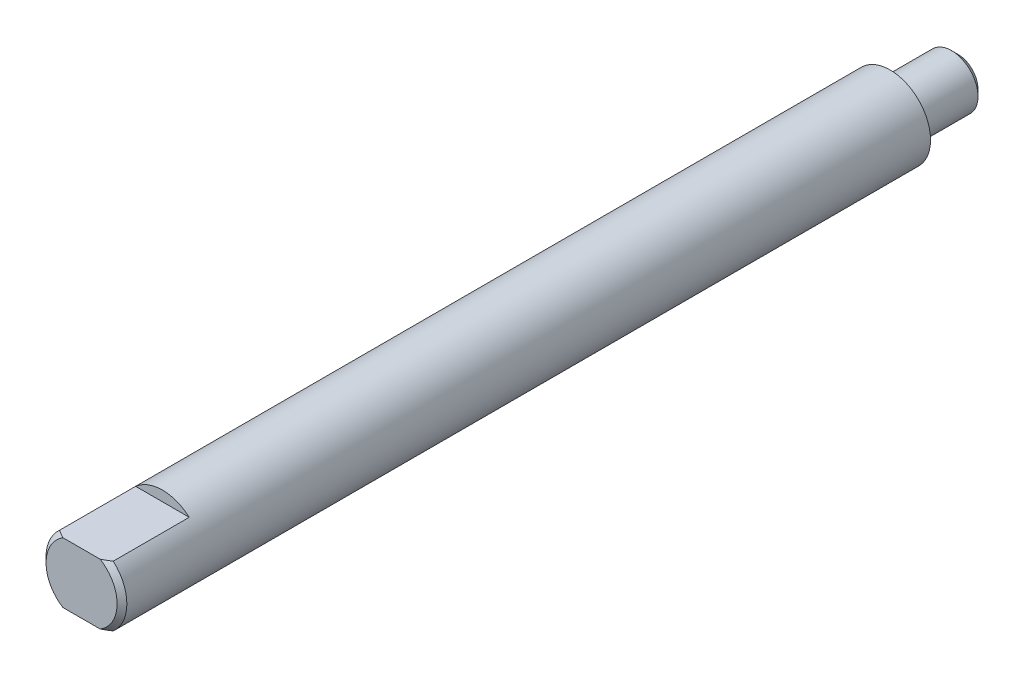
ISO-10303-21;
HEADER;
FILE_DESCRIPTION(('STEP AP214'),'2;1');
FILE_NAME('part.step','',(''),(''),'','','');
FILE_SCHEMA(('AUTOMOTIVE_DESIGN { 1 0 10303 214 1 1 1 1 }'));
ENDSEC;
DATA;
#1=APPLICATION_CONTEXT('core data for automotive mechanical design processes');
#2=APPLICATION_PROTOCOL_DEFINITION('international standard','automotive_design',2000,#1);
#3=PRODUCT_CONTEXT('',#1,'mechanical');
#4=PRODUCT('Part','Part','',(#3));
#5=PRODUCT_RELATED_PRODUCT_CATEGORY('part','',(#4));
#6=PRODUCT_DEFINITION_FORMATION('','',#4);
#7=PRODUCT_DEFINITION_CONTEXT('part definition',#1,'design');
#8=PRODUCT_DEFINITION('design','',#6,#7);
#9=PRODUCT_DEFINITION_SHAPE('','',#8);
#10=(LENGTH_UNIT() NAMED_UNIT(*) SI_UNIT(.MILLI.,.METRE.));
#11=(NAMED_UNIT(*) PLANE_ANGLE_UNIT() SI_UNIT($,.RADIAN.));
#12=(NAMED_UNIT(*) SI_UNIT($,.STERADIAN.) SOLID_ANGLE_UNIT());
#13=UNCERTAINTY_MEASURE_WITH_UNIT(LENGTH_MEASURE(1.E-05),#10,'distance_accuracy_value','');
#14=(GEOMETRIC_REPRESENTATION_CONTEXT(3) GLOBAL_UNCERTAINTY_ASSIGNED_CONTEXT((#13)) GLOBAL_UNIT_ASSIGNED_CONTEXT((#10,
#11,#12)) REPRESENTATION_CONTEXT('',''));
#15=CARTESIAN_POINT('',(0.,0.,0.));
#16=DIRECTION('',(0.,0.,1.));
#17=DIRECTION('',(1.,0.,0.));
#18=AXIS2_PLACEMENT_3D('',#15,#16,#17);
#19=CARTESIAN_POINT('',(0.,0.,3.684));
#20=DIRECTION('',(0.,0.,-1.));
#21=DIRECTION('',(-1.,0.,0.));
#22=AXIS2_PLACEMENT_3D('',#19,#20,#21);
#23=CONICAL_SURFACE('',#22,3.175,0.791934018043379);
#24=CARTESIAN_POINT('',(0.,0.,3.684));
#25=DIRECTION('',(0.,0.,1.));
#26=DIRECTION('',(1.,0.,0.));
#27=AXIS2_PLACEMENT_3D('',#24,#25,#26);
#28=CIRCLE('',#27,3.175);
#29=CARTESIAN_POINT('',(-2.10713075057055,2.375,3.684));
#30=VERTEX_POINT('',#29);
#31=CARTESIAN_POINT('',(-2.10713075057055,-2.375,3.684));
#32=VERTEX_POINT('',#31);
#33=EDGE_CURVE('E105',#30,#32,#28,.T.);
#34=ORIENTED_EDGE('',*,*,#33,.T.);
#35=CARTESIAN_POINT('',(-6.62966945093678,-2.375,-0.13301595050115));
#36=CARTESIAN_POINT('',(-6.41872085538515,-2.375,0.0629362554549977));
#37=CARTESIAN_POINT('',(-6.20729327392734,-2.375,0.258380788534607));
#38=CARTESIAN_POINT('',(-5.78286017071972,-2.375,0.64788739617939));
#39=CARTESIAN_POINT('',(-5.56985352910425,-2.375,0.841948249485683));
#40=CARTESIAN_POINT('',(-5.13574053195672,-2.375,1.23363349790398));
#41=CARTESIAN_POINT('',(-4.9145790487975,-2.375,1.43119690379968));
#42=CARTESIAN_POINT('',(-4.46963283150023,-2.375,1.82304516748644));
#43=CARTESIAN_POINT('',(-4.24585006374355,-2.375,2.01733224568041));
#44=CARTESIAN_POINT('',(-3.90719638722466,-2.375,2.30510248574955));
#45=CARTESIAN_POINT('',(-3.79385459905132,-2.375,2.40038380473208));
#46=CARTESIAN_POINT('',(-3.56590809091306,-2.375,2.5894215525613));
#47=CARTESIAN_POINT('',(-3.4513034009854,-2.375,2.68317801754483));
#48=CARTESIAN_POINT('',(-3.22025369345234,-2.375,2.86895465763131));
#49=CARTESIAN_POINT('',(-3.10380502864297,-2.375,2.96097030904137));
#50=CARTESIAN_POINT('',(-2.8689222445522,-2.375,3.14241965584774));
#51=CARTESIAN_POINT('',(-2.75048831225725,-2.375,3.23185359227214));
#52=CARTESIAN_POINT('',(-2.51255729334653,-2.375,3.40617108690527));
#53=CARTESIAN_POINT('',(-2.3930916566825,-2.375,3.49109735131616));
#54=CARTESIAN_POINT('',(-2.1509050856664,-2.375,3.65634247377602));
#55=CARTESIAN_POINT('',(-2.02818269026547,-2.375,3.73665921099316));
#56=CARTESIAN_POINT('',(-1.77912466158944,-2.375,3.89039659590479));
#57=CARTESIAN_POINT('',(-1.65280524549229,-2.375,3.96384327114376));
#58=CARTESIAN_POINT('',(-1.39512518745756,-2.375,4.10119391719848));
#59=CARTESIAN_POINT('',(-1.26377071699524,-2.375,4.16510912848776));
#60=CARTESIAN_POINT('',(-1.05701971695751,-2.375,4.25273595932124));
#61=CARTESIAN_POINT('',(-0.983728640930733,-2.375,4.28140199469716));
#62=CARTESIAN_POINT('',(-0.83535687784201,-2.375,4.3337772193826));
#63=CARTESIAN_POINT('',(-0.760275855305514,-2.375,4.35748547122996));
#64=CARTESIAN_POINT('',(-0.608898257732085,-2.375,4.39885359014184));
#65=CARTESIAN_POINT('',(-0.532610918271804,-2.375,4.41654679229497));
#66=CARTESIAN_POINT('',(-0.378780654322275,-2.375,4.445154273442));
#67=CARTESIAN_POINT('',(-0.301238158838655,-2.375,4.45607082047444));
#68=CARTESIAN_POINT('',(-0.144559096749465,-2.375,4.47054748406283));
#69=CARTESIAN_POINT('',(-0.0654144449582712,-2.375,4.47402190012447));
#70=CARTESIAN_POINT('',(0.0928249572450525,-2.375,4.47312081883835));
#71=CARTESIAN_POINT('',(0.171919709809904,-2.375,4.4687456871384));
#72=CARTESIAN_POINT('',(0.329626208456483,-2.375,4.45241265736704));
#73=CARTESIAN_POINT('',(0.408234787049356,-2.375,4.44042470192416));
#74=CARTESIAN_POINT('',(0.56408615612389,-2.375,4.40957980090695));
#75=CARTESIAN_POINT('',(0.641328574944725,-2.375,4.39072101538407));
#76=CARTESIAN_POINT('',(0.827865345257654,-2.375,4.33746225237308));
#77=CARTESIAN_POINT('',(0.936246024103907,-2.375,4.29987709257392));
#78=CARTESIAN_POINT('',(1.14927492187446,-2.375,4.21535984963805));
#79=CARTESIAN_POINT('',(1.25392057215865,-2.375,4.16842147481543));
#80=CARTESIAN_POINT('',(1.46087103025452,-2.375,4.06709514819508));
#81=CARTESIAN_POINT('',(1.56313950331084,-2.375,4.01263383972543));
#82=CARTESIAN_POINT('',(1.71427099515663,-2.375,3.92703840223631));
#83=CARTESIAN_POINT('',(1.76426245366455,-2.375,3.89786057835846));
#84=CARTESIAN_POINT('',(1.86356372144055,-2.375,3.83837009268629));
#85=CARTESIAN_POINT('',(1.91287355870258,-2.375,3.80805747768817));
#86=CARTESIAN_POINT('',(2.07522042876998,-2.375,3.70601224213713));
#87=CARTESIAN_POINT('',(2.18692206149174,-2.375,3.63215349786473));
#88=CARTESIAN_POINT('',(2.40772318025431,-2.375,3.48062951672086));
#89=CARTESIAN_POINT('',(2.5168220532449,-2.375,3.40296339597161));
#90=CARTESIAN_POINT('',(2.73301390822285,-2.375,3.24473477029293));
#91=CARTESIAN_POINT('',(2.84010537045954,-2.375,3.16417019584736));
#92=CARTESIAN_POINT('',(3.05261723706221,-2.375,3.00086187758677));
#93=CARTESIAN_POINT('',(3.15803753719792,-2.375,2.9181179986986));
#94=CARTESIAN_POINT('',(3.47300086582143,-2.375,2.6667998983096));
#95=CARTESIAN_POINT('',(3.68051445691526,-2.375,2.49568568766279));
#96=CARTESIAN_POINT('',(4.09182405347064,-2.375,2.14926116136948));
#97=CARTESIAN_POINT('',(4.29562161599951,-2.375,1.97395267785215));
#98=CARTESIAN_POINT('',(4.67931232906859,-2.375,1.63905531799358));
#99=CARTESIAN_POINT('',(4.85946034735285,-2.375,1.47975783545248));
#100=CARTESIAN_POINT('',(5.21824582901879,-2.375,1.15942835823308));
#101=CARTESIAN_POINT('',(5.39688309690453,-2.375,0.998396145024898));
#102=CARTESIAN_POINT('',(5.75173692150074,-2.375,0.676174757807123));
#103=CARTESIAN_POINT('',(5.92796166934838,-2.375,0.514994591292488));
#104=CARTESIAN_POINT('',(6.27946145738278,-2.375,0.191659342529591));
#105=CARTESIAN_POINT('',(6.45473664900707,-2.375,0.0295044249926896));
#106=CARTESIAN_POINT('',(6.62966945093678,-2.375,-0.13301595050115));
#107=B_SPLINE_CURVE_WITH_KNOTS('',3,(#35,#36,#37,#38,#39,#40,#41,#42,#43,#44,#45,#46,#47,#48,
#49,#50,#51,#52,#53,#54,#55,#56,#57,#58,#59,#60,#61,#62,#63,#64,#65,#66,#67,#68,#69,#70,#71,#72,
#73,#74,#75,#76,#77,#78,#79,#80,#81,#82,#83,#84,#85,#86,#87,#88,#89,#90,#91,#92,#93,#94,#95,#96,
#97,#98,#99,#100,#101,#102,#103,#104,#105,#106),.UNSPECIFIED.,.F.,.F.,(4,2,2,2,2,2,2,2,2,2,2,2,
2,2,2,2,2,2,2,2,2,2,2,2,2,2,2,2,2,2,2,2,2,2,2,4),(0.,0.863760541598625,1.72820709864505,
2.61784876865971,3.50686109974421,3.95106286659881,4.39525409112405,4.84047397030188,
5.28565214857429,5.72530383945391,6.16515621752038,6.60326828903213,7.04085953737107,
7.2768120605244,7.51280915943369,7.74747620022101,7.98206465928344,8.21934033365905,
8.45660495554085,8.69481223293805,8.93308334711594,9.27660606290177,9.62036064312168,
9.96774119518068,10.1413805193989,10.3150126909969,10.7166254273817,11.1183318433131,
11.5203310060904,11.9223551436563,12.7291420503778,13.5355827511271,14.2569976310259,
14.9785044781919,15.6949553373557,16.4112883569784),.UNSPECIFIED.);
#108=CARTESIAN_POINT('',(-1.46406113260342,-2.375,4.064));
#109=VERTEX_POINT('',#108);
#110=EDGE_CURVE('E128',#32,#109,#107,.T.);
#111=ORIENTED_EDGE('',*,*,#110,.T.);
#112=CARTESIAN_POINT('',(0.,0.,4.064));
#113=DIRECTION('',(0.,0.,1.));
#114=DIRECTION('',(1.,0.,0.));
#115=AXIS2_PLACEMENT_3D('',#112,#113,#114);
#116=CIRCLE('',#115,2.79);
#117=CARTESIAN_POINT('',(-1.46406113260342,2.375,4.064));
#118=VERTEX_POINT('',#117);
#119=EDGE_CURVE('E115',#118,#109,#116,.T.);
#120=ORIENTED_EDGE('',*,*,#119,.F.);
#121=CARTESIAN_POINT('',(6.62966945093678,2.375,-0.13301595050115));
#122=CARTESIAN_POINT('',(6.41872085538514,2.375,0.0629362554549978));
#123=CARTESIAN_POINT('',(6.20729327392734,2.375,0.258380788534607));
#124=CARTESIAN_POINT('',(5.78286017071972,2.375,0.64788739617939));
#125=CARTESIAN_POINT('',(5.56985352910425,2.375,0.841948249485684));
#126=CARTESIAN_POINT('',(5.13574053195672,2.375,1.23363349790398));
#127=CARTESIAN_POINT('',(4.9145790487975,2.375,1.43119690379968));
#128=CARTESIAN_POINT('',(4.46963283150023,2.375,1.82304516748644));
#129=CARTESIAN_POINT('',(4.24585006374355,2.375,2.01733224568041));
#130=CARTESIAN_POINT('',(3.90719638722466,2.375,2.30510248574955));
#131=CARTESIAN_POINT('',(3.79385459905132,2.375,2.40038380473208));
#132=CARTESIAN_POINT('',(3.56590809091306,2.375,2.5894215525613));
#133=CARTESIAN_POINT('',(3.4513034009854,2.375,2.68317801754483));
#134=CARTESIAN_POINT('',(3.22025369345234,2.375,2.86895465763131));
#135=CARTESIAN_POINT('',(3.10380502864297,2.375,2.96097030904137));
#136=CARTESIAN_POINT('',(2.8689222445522,2.375,3.14241965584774));
#137=CARTESIAN_POINT('',(2.75048831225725,2.375,3.23185359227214));
#138=CARTESIAN_POINT('',(2.51255729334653,2.375,3.40617108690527));
#139=CARTESIAN_POINT('',(2.3930916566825,2.375,3.49109735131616));
#140=CARTESIAN_POINT('',(2.1509050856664,2.375,3.65634247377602));
#141=CARTESIAN_POINT('',(2.02818269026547,2.375,3.73665921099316));
#142=CARTESIAN_POINT('',(1.77912466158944,2.375,3.89039659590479));
#143=CARTESIAN_POINT('',(1.65280524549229,2.375,3.96384327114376));
#144=CARTESIAN_POINT('',(1.39512518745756,2.375,4.10119391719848));
#145=CARTESIAN_POINT('',(1.26377071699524,2.375,4.16510912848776));
#146=CARTESIAN_POINT('',(1.05701971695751,2.375,4.25273595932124));
#147=CARTESIAN_POINT('',(0.983728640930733,2.375,4.28140199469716));
#148=CARTESIAN_POINT('',(0.83535687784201,2.375,4.3337772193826));
#149=CARTESIAN_POINT('',(0.760275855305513,2.375,4.35748547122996));
#150=CARTESIAN_POINT('',(0.608898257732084,2.375,4.39885359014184));
#151=CARTESIAN_POINT('',(0.532610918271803,2.375,4.41654679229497));
#152=CARTESIAN_POINT('',(0.378780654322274,2.375,4.445154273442));
#153=CARTESIAN_POINT('',(0.301238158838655,2.375,4.45607082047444));
#154=CARTESIAN_POINT('',(0.144559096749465,2.375,4.47054748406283));
#155=CARTESIAN_POINT('',(0.0654144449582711,2.375,4.47402190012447));
#156=CARTESIAN_POINT('',(-0.0928249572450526,2.375,4.47312081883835));
#157=CARTESIAN_POINT('',(-0.171919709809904,2.375,4.4687456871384));
#158=CARTESIAN_POINT('',(-0.329626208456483,2.375,4.45241265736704));
#159=CARTESIAN_POINT('',(-0.408234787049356,2.375,4.44042470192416));
#160=CARTESIAN_POINT('',(-0.56408615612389,2.375,4.40957980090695));
#161=CARTESIAN_POINT('',(-0.641328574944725,2.375,4.39072101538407));
#162=CARTESIAN_POINT('',(-0.827865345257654,2.375,4.33746225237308));
#163=CARTESIAN_POINT('',(-0.936246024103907,2.375,4.29987709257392));
#164=CARTESIAN_POINT('',(-1.14927492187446,2.375,4.21535984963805));
#165=CARTESIAN_POINT('',(-1.25392057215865,2.375,4.16842147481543));
#166=CARTESIAN_POINT('',(-1.46087103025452,2.375,4.06709514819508));
#167=CARTESIAN_POINT('',(-1.56313950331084,2.375,4.01263383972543));
#168=CARTESIAN_POINT('',(-1.71427099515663,2.375,3.92703840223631));
#169=CARTESIAN_POINT('',(-1.76426245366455,2.375,3.89786057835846));
#170=CARTESIAN_POINT('',(-1.86356372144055,2.375,3.83837009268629));
#171=CARTESIAN_POINT('',(-1.91287355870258,2.375,3.80805747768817));
#172=CARTESIAN_POINT('',(-2.07522042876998,2.375,3.70601224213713));
#173=CARTESIAN_POINT('',(-2.18692206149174,2.375,3.63215349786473));
#174=CARTESIAN_POINT('',(-2.40772318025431,2.375,3.48062951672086));
#175=CARTESIAN_POINT('',(-2.51682205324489,2.375,3.40296339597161));
#176=CARTESIAN_POINT('',(-2.73301390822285,2.375,3.24473477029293));
#177=CARTESIAN_POINT('',(-2.84010537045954,2.375,3.16417019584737));
#178=CARTESIAN_POINT('',(-3.05261723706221,2.375,3.00086187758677));
#179=CARTESIAN_POINT('',(-3.15803753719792,2.375,2.91811799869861));
#180=CARTESIAN_POINT('',(-3.47300086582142,2.375,2.66679989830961));
#181=CARTESIAN_POINT('',(-3.68051445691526,2.375,2.49568568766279));
#182=CARTESIAN_POINT('',(-4.09182405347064,2.375,2.14926116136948));
#183=CARTESIAN_POINT('',(-4.29562161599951,2.375,1.97395267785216));
#184=CARTESIAN_POINT('',(-4.67931232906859,2.375,1.63905531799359));
#185=CARTESIAN_POINT('',(-4.85946034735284,2.375,1.47975783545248));
#186=CARTESIAN_POINT('',(-5.21824582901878,2.375,1.15942835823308));
#187=CARTESIAN_POINT('',(-5.39688309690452,2.375,0.998396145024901));
#188=CARTESIAN_POINT('',(-5.75173692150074,2.375,0.676174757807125));
#189=CARTESIAN_POINT('',(-5.92796166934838,2.375,0.514994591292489));
#190=CARTESIAN_POINT('',(-6.27946145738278,2.375,0.191659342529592));
#191=CARTESIAN_POINT('',(-6.45473664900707,2.375,0.0295044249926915));
#192=CARTESIAN_POINT('',(-6.62966945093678,2.375,-0.13301595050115));
#193=B_SPLINE_CURVE_WITH_KNOTS('',3,(#121,#122,#123,#124,#125,#126,#127,#128,#129,#130,#131,
#132,#133,#134,#135,#136,#137,#138,#139,#140,#141,#142,#143,#144,#145,#146,#147,#148,#149,#150,
#151,#152,#153,#154,#155,#156,#157,#158,#159,#160,#161,#162,#163,#164,#165,#166,#167,#168,#169,
#170,#171,#172,#173,#174,#175,#176,#177,#178,#179,#180,#181,#182,#183,#184,#185,#186,#187,#188,
#189,#190,#191,#192),.UNSPECIFIED.,.F.,.F.,(4,2,2,2,2,2,2,2,2,2,2,2,2,2,2,2,2,2,2,2,2,2,2,2,2,2,
2,2,2,2,2,2,2,2,2,4),(0.,0.863760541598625,1.72820709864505,2.61784876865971,3.50686109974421,
3.95106286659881,4.39525409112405,4.84047397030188,5.28565214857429,5.72530383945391,
6.16515621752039,6.60326828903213,7.04085953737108,7.2768120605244,7.51280915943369,
7.74747620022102,7.98206465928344,8.21934033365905,8.45660495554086,8.69481223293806,
8.93308334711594,9.27660606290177,9.62036064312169,9.96774119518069,10.1413805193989,
10.3150126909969,10.7166254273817,11.1183318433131,11.5203310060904,11.9223551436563,
12.7291420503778,13.5355827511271,14.2569976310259,14.9785044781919,15.6949553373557,
16.4112883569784),.UNSPECIFIED.);
#194=EDGE_CURVE('E129',#118,#30,#193,.T.);
#195=ORIENTED_EDGE('',*,*,#194,.T.);
#196=EDGE_LOOP('',(#34,#111,#120,#195));
#197=FACE_BOUND('',#196,.T.);
#198=ADVANCED_FACE('F33',(#197),#23,.T.);
#199=CARTESIAN_POINT('',(0.,0.,4.064));
#200=DIRECTION('',(0.,0.,-1.));
#201=DIRECTION('',(-1.,0.,0.));
#202=AXIS2_PLACEMENT_3D('',#199,#200,#201);
#203=PLANE('',#202);
#204=ORIENTED_EDGE('',*,*,#119,.T.);
#205=DIRECTION('',(1.,0.,0.));
#206=VECTOR('',#205,1.);
#207=CARTESIAN_POINT('',(-5.,-2.375,4.064));
#208=LINE('',#207,#206);
#209=CARTESIAN_POINT('',(1.46406113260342,-2.375,4.064));
#210=VERTEX_POINT('',#209);
#211=EDGE_CURVE('E95',#109,#210,#208,.T.);
#212=ORIENTED_EDGE('',*,*,#211,.T.);
#213=CARTESIAN_POINT('',(1.46406113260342,2.375,4.064));
#214=VERTEX_POINT('',#213);
#215=EDGE_CURVE('E109',#210,#214,#116,.T.);
#216=ORIENTED_EDGE('',*,*,#215,.T.);
#217=DIRECTION('',(1.,0.,0.));
#218=VECTOR('',#217,1.);
#219=CARTESIAN_POINT('',(-5.,2.375,4.064));
#220=LINE('',#219,#218);
#221=EDGE_CURVE('E135',#118,#214,#220,.T.);
#222=ORIENTED_EDGE('',*,*,#221,.F.);
#223=EDGE_LOOP('',(#204,#212,#216,#222));
#224=FACE_BOUND('',#223,.T.);
#225=ADVANCED_FACE('F35',(#224),#203,.F.);
#226=ORIENTED_EDGE('',*,*,#215,.F.);
#227=CARTESIAN_POINT('',(2.10713075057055,-2.375,3.684));
#228=VERTEX_POINT('',#227);
#229=EDGE_CURVE('E94',#210,#228,#107,.T.);
#230=ORIENTED_EDGE('',*,*,#229,.T.);
#231=CARTESIAN_POINT('',(2.10713075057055,2.375,3.684));
#232=VERTEX_POINT('',#231);
#233=EDGE_CURVE('E101',#228,#232,#28,.T.);
#234=ORIENTED_EDGE('',*,*,#233,.T.);
#235=EDGE_CURVE('E132',#232,#214,#193,.T.);
#236=ORIENTED_EDGE('',*,*,#235,.T.);
#237=EDGE_LOOP('',(#226,#230,#234,#236));
#238=FACE_BOUND('',#237,.T.);
#239=ADVANCED_FACE('F144',(#238),#23,.T.);
#240=CARTESIAN_POINT('',(0.,0.,4.064));
#241=DIRECTION('',(0.,0.,1.));
#242=DIRECTION('',(1.,0.,0.));
#243=AXIS2_PLACEMENT_3D('',#240,#241,#242);
#244=CYLINDRICAL_SURFACE('',#243,3.175);
#245=ORIENTED_EDGE('',*,*,#233,.F.);
#246=DIRECTION('',(0.,0.,1.));
#247=VECTOR('',#246,1.);
#248=CARTESIAN_POINT('',(2.10713075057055,-2.375,4.064));
#249=LINE('',#248,#247);
#250=CARTESIAN_POINT('',(2.10713075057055,-2.375,-2.286));
#251=VERTEX_POINT('',#250);
#252=EDGE_CURVE('E11',#228,#251,#249,.F.);
#253=ORIENTED_EDGE('',*,*,#252,.T.);
#254=CARTESIAN_POINT('',(0.,0.,-2.28600000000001));
#255=DIRECTION('',(0.,0.,-1.));
#256=DIRECTION('',(0.,1.,0.));
#257=AXIS2_PLACEMENT_3D('',#254,#255,#256);
#258=CIRCLE('',#257,3.175);
#259=CARTESIAN_POINT('',(-2.10713075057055,-2.375,-2.286));
#260=VERTEX_POINT('',#259);
#261=EDGE_CURVE('E85',#251,#260,#258,.T.);
#262=ORIENTED_EDGE('',*,*,#261,.T.);
#263=DIRECTION('',(0.,0.,1.));
#264=VECTOR('',#263,1.);
#265=CARTESIAN_POINT('',(-2.10713075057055,-2.375,4.064));
#266=LINE('',#265,#264);
#267=EDGE_CURVE('E41',#260,#32,#266,.T.);
#268=ORIENTED_EDGE('',*,*,#267,.T.);
#269=ORIENTED_EDGE('',*,*,#33,.F.);
#270=DIRECTION('',(0.,0.,1.));
#271=VECTOR('',#270,1.);
#272=CARTESIAN_POINT('',(-2.10713075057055,2.375,4.064));
#273=LINE('',#272,#271);
#274=CARTESIAN_POINT('',(-2.10713075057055,2.375,-2.286));
#275=VERTEX_POINT('',#274);
#276=EDGE_CURVE('E118',#30,#275,#273,.F.);
#277=ORIENTED_EDGE('',*,*,#276,.T.);
#278=CARTESIAN_POINT('',(0.,0.,-2.28600000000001));
#279=DIRECTION('',(0.,0.,-1.));
#280=DIRECTION('',(0.,1.,0.));
#281=AXIS2_PLACEMENT_3D('',#278,#279,#280);
#282=CIRCLE('',#281,3.175);
#283=CARTESIAN_POINT('',(2.10713075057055,2.375,-2.286));
#284=VERTEX_POINT('',#283);
#285=EDGE_CURVE('E121',#275,#284,#282,.T.);
#286=ORIENTED_EDGE('',*,*,#285,.T.);
#287=DIRECTION('',(0.,0.,1.));
#288=VECTOR('',#287,1.);
#289=CARTESIAN_POINT('',(2.10713075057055,2.375,4.064));
#290=LINE('',#289,#288);
#291=EDGE_CURVE('E89',#284,#232,#290,.T.);
#292=ORIENTED_EDGE('',*,*,#291,.T.);
#293=EDGE_LOOP('',(#245,#253,#262,#268,#269,#277,#286,#292));
#294=FACE_BOUND('',#293,.T.);
#295=CARTESIAN_POINT('',(0.,0.,-59.436));
#296=DIRECTION('',(0.,0.,1.));
#297=DIRECTION('',(1.,0.,0.));
#298=AXIS2_PLACEMENT_3D('',#295,#296,#297);
#299=CIRCLE('',#298,3.175);
#300=CARTESIAN_POINT('',(3.175,0.,-59.436));
#301=VERTEX_POINT('',#300);
#302=EDGE_CURVE('E106',#301,#301,#299,.T.);
#303=ORIENTED_EDGE('',*,*,#302,.T.);
#304=EDGE_LOOP('',(#303));
#305=FACE_BOUND('',#304,.T.);
#306=ADVANCED_FACE('F98',(#294,#305),#244,.T.);
#307=CARTESIAN_POINT('',(0.,2.0828,-59.436));
#308=DIRECTION('',(0.,0.,1.));
#309=DIRECTION('',(1.,0.,0.));
#310=AXIS2_PLACEMENT_3D('',#307,#308,#309);
#311=PLANE('',#310);
#312=ORIENTED_EDGE('',*,*,#302,.F.);
#313=EDGE_LOOP('',(#312));
#314=FACE_BOUND('',#313,.T.);
#315=CARTESIAN_POINT('',(0.,0.,-59.436));
#316=DIRECTION('',(0.,0.,1.));
#317=DIRECTION('',(1.,0.,0.));
#318=AXIS2_PLACEMENT_3D('',#315,#316,#317);
#319=CIRCLE('',#318,2.0828);
#320=CARTESIAN_POINT('',(2.0828,0.,-59.436));
#321=VERTEX_POINT('',#320);
#322=EDGE_CURVE('E111',#321,#321,#319,.T.);
#323=ORIENTED_EDGE('',*,*,#322,.T.);
#324=EDGE_LOOP('',(#323));
#325=FACE_BOUND('',#324,.T.);
#326=ADVANCED_FACE('F165',(#314,#325),#311,.F.);
#327=CARTESIAN_POINT('',(0.,0.,4.064));
#328=DIRECTION('',(0.,0.,1.));
#329=DIRECTION('',(1.,0.,0.));
#330=AXIS2_PLACEMENT_3D('',#327,#328,#329);
#331=CYLINDRICAL_SURFACE('',#330,2.0828);
#332=ORIENTED_EDGE('',*,*,#322,.F.);
#333=EDGE_LOOP('',(#332));
#334=FACE_BOUND('',#333,.T.);
#335=CARTESIAN_POINT('',(0.,0.,-64.256));
#336=DIRECTION('',(0.,0.,1.));
#337=DIRECTION('',(1.,0.,0.));
#338=AXIS2_PLACEMENT_3D('',#335,#336,#337);
#339=CIRCLE('',#338,2.0828);
#340=CARTESIAN_POINT('',(2.0828,0.,-64.256));
#341=VERTEX_POINT('',#340);
#342=EDGE_CURVE('E263',#341,#341,#339,.T.);
#343=ORIENTED_EDGE('',*,*,#342,.T.);
#344=EDGE_LOOP('',(#343));
#345=FACE_BOUND('',#344,.T.);
#346=ADVANCED_FACE('F161',(#334,#345),#331,.T.);
#347=CARTESIAN_POINT('',(0.,0.,-64.766));
#348=DIRECTION('',(0.,0.,1.));
#349=DIRECTION('',(1.,0.,0.));
#350=AXIS2_PLACEMENT_3D('',#347,#348,#349);
#351=CONICAL_SURFACE('',#350,1.57280000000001,0.785398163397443);
#352=ORIENTED_EDGE('',*,*,#342,.F.);
#353=EDGE_LOOP('',(#352));
#354=FACE_BOUND('',#353,.T.);
#355=CARTESIAN_POINT('',(0.,0.,-64.766));
#356=DIRECTION('',(0.,0.,1.));
#357=DIRECTION('',(1.,0.,0.));
#358=AXIS2_PLACEMENT_3D('',#355,#356,#357);
#359=CIRCLE('',#358,1.57280000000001);
#360=CARTESIAN_POINT('',(1.57280000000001,0.,-64.766));
#361=VERTEX_POINT('',#360);
#362=EDGE_CURVE('E134',#361,#361,#359,.T.);
#363=ORIENTED_EDGE('',*,*,#362,.T.);
#364=EDGE_LOOP('',(#363));
#365=FACE_BOUND('',#364,.T.);
#366=ADVANCED_FACE('F157',(#354,#365),#351,.T.);
#367=CARTESIAN_POINT('',(0.,0.,-64.766));
#368=DIRECTION('',(0.,0.,1.));
#369=DIRECTION('',(1.,0.,0.));
#370=AXIS2_PLACEMENT_3D('',#367,#368,#369);
#371=PLANE('',#370);
#372=ORIENTED_EDGE('',*,*,#362,.F.);
#373=EDGE_LOOP('',(#372));
#374=FACE_BOUND('',#373,.T.);
#375=ADVANCED_FACE('F154',(#374),#371,.F.);
#376=CARTESIAN_POINT('',(-5.,2.375,-2.286));
#377=DIRECTION('',(0.,0.,-1.));
#378=DIRECTION('',(0.,1.,0.));
#379=AXIS2_PLACEMENT_3D('',#376,#377,#378);
#380=PLANE('',#379);
#381=ORIENTED_EDGE('',*,*,#285,.F.);
#382=DIRECTION('',(1.,0.,0.));
#383=VECTOR('',#382,1.);
#384=CARTESIAN_POINT('',(-5.,2.375,-2.286));
#385=LINE('',#384,#383);
#386=EDGE_CURVE('E55',#275,#284,#385,.T.);
#387=ORIENTED_EDGE('',*,*,#386,.T.);
#388=EDGE_LOOP('',(#381,#387));
#389=FACE_BOUND('',#388,.T.);
#390=ADVANCED_FACE('F152',(#389),#380,.F.);
#391=CARTESIAN_POINT('',(-5.,2.375,4.064));
#392=DIRECTION('',(0.,-1.,0.));
#393=DIRECTION('',(0.,0.,-1.));
#394=AXIS2_PLACEMENT_3D('',#391,#392,#393);
#395=PLANE('',#394);
#396=ORIENTED_EDGE('',*,*,#291,.F.);
#397=ORIENTED_EDGE('',*,*,#386,.F.);
#398=ORIENTED_EDGE('',*,*,#276,.F.);
#399=ORIENTED_EDGE('',*,*,#194,.F.);
#400=ORIENTED_EDGE('',*,*,#221,.T.);
#401=ORIENTED_EDGE('',*,*,#235,.F.);
#402=EDGE_LOOP('',(#396,#397,#398,#399,#400,#401));
#403=FACE_BOUND('',#402,.T.);
#404=ADVANCED_FACE('F147',(#403),#395,.F.);
#405=CARTESIAN_POINT('',(-5.,-2.375,4.064));
#406=DIRECTION('',(0.,1.,0.));
#407=DIRECTION('',(0.,0.,1.));
#408=AXIS2_PLACEMENT_3D('',#405,#406,#407);
#409=PLANE('',#408);
#410=ORIENTED_EDGE('',*,*,#267,.F.);
#411=DIRECTION('',(1.,0.,0.));
#412=VECTOR('',#411,1.);
#413=CARTESIAN_POINT('',(-5.,-2.375,-2.286));
#414=LINE('',#413,#412);
#415=EDGE_CURVE('E47',#260,#251,#414,.T.);
#416=ORIENTED_EDGE('',*,*,#415,.T.);
#417=ORIENTED_EDGE('',*,*,#252,.F.);
#418=ORIENTED_EDGE('',*,*,#229,.F.);
#419=ORIENTED_EDGE('',*,*,#211,.F.);
#420=ORIENTED_EDGE('',*,*,#110,.F.);
#421=EDGE_LOOP('',(#410,#416,#417,#418,#419,#420));
#422=FACE_BOUND('',#421,.T.);
#423=ADVANCED_FACE('F92',(#422),#409,.F.);
#424=CARTESIAN_POINT('',(-5.,-2.375,-2.286));
#425=DIRECTION('',(0.,0.,-1.));
#426=DIRECTION('',(0.,1.,0.));
#427=AXIS2_PLACEMENT_3D('',#424,#425,#426);
#428=PLANE('',#427);
#429=ORIENTED_EDGE('',*,*,#415,.F.);
#430=ORIENTED_EDGE('',*,*,#261,.F.);
#431=EDGE_LOOP('',(#429,#430));
#432=FACE_BOUND('',#431,.T.);
#433=ADVANCED_FACE('F86',(#432),#428,.F.);
#434=CLOSED_SHELL('',(#198,#225,#239,#306,#326,#346,#366,#375,#390,#404,#423,#433));
#435=MANIFOLD_SOLID_BREP('B2',#434);
#436=ADVANCED_BREP_SHAPE_REPRESENTATION('',(#18,#435),#14);
#437=SHAPE_DEFINITION_REPRESENTATION(#9,#436);
ENDSEC;
END-ISO-10303-21;
